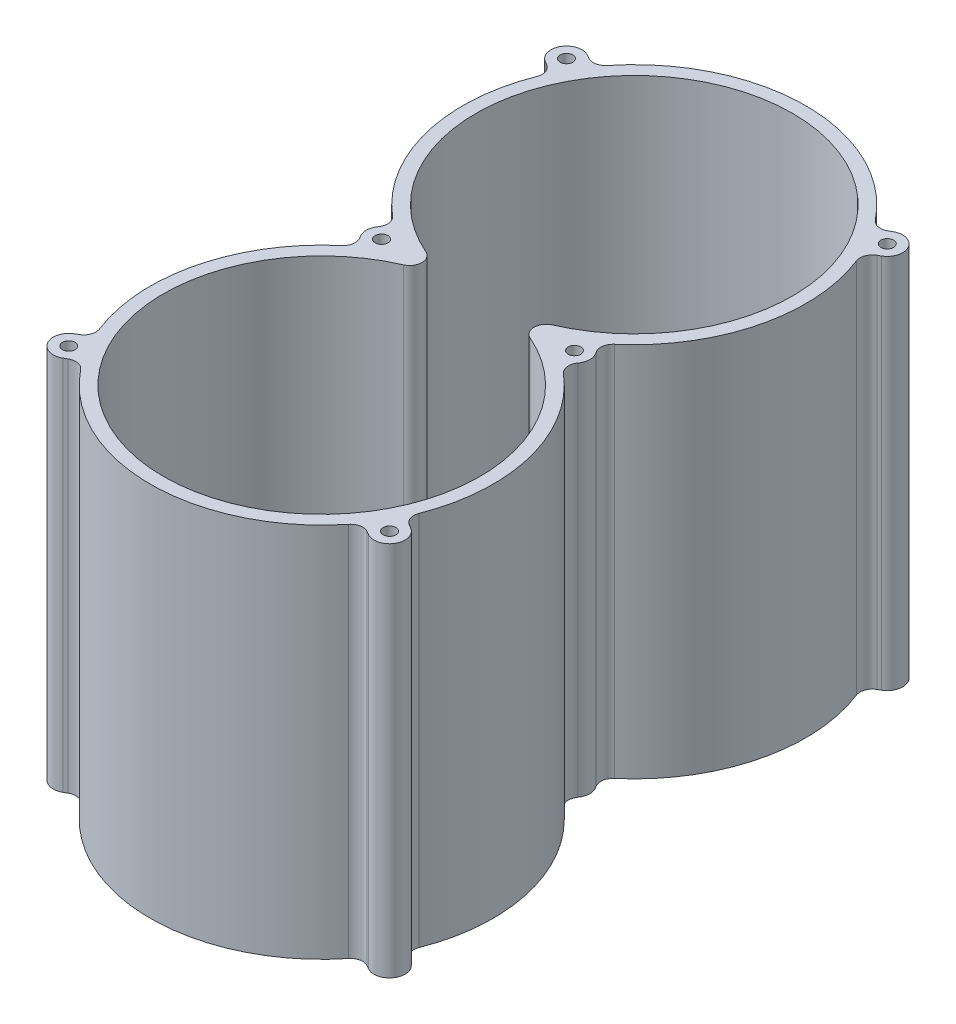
ISO-10303-21;
HEADER;
FILE_DESCRIPTION(('STEP AP214'),'2;1');
FILE_NAME('part.step','',(''),(''),'','','');
FILE_SCHEMA(('AUTOMOTIVE_DESIGN { 1 0 10303 214 1 1 1 1 }'));
ENDSEC;
DATA;
#1=APPLICATION_CONTEXT('core data for automotive mechanical design processes');
#2=APPLICATION_PROTOCOL_DEFINITION('international standard','automotive_design',2000,#1);
#3=PRODUCT_CONTEXT('',#1,'mechanical');
#4=PRODUCT('Part','Part','',(#3));
#5=PRODUCT_RELATED_PRODUCT_CATEGORY('part','',(#4));
#6=PRODUCT_DEFINITION_FORMATION('','',#4);
#7=PRODUCT_DEFINITION_CONTEXT('part definition',#1,'design');
#8=PRODUCT_DEFINITION('design','',#6,#7);
#9=PRODUCT_DEFINITION_SHAPE('','',#8);
#10=(LENGTH_UNIT() NAMED_UNIT(*) SI_UNIT(.MILLI.,.METRE.));
#11=(NAMED_UNIT(*) PLANE_ANGLE_UNIT() SI_UNIT($,.RADIAN.));
#12=(NAMED_UNIT(*) SI_UNIT($,.STERADIAN.) SOLID_ANGLE_UNIT());
#13=UNCERTAINTY_MEASURE_WITH_UNIT(LENGTH_MEASURE(1.E-05),#10,'distance_accuracy_value','');
#14=(GEOMETRIC_REPRESENTATION_CONTEXT(3) GLOBAL_UNCERTAINTY_ASSIGNED_CONTEXT((#13)) GLOBAL_UNIT_ASSIGNED_CONTEXT((#10,
#11,#12)) REPRESENTATION_CONTEXT('',''));
#15=CARTESIAN_POINT('',(0.,0.,0.));
#16=DIRECTION('',(0.,0.,1.));
#17=DIRECTION('',(1.,0.,0.));
#18=AXIS2_PLACEMENT_3D('',#15,#16,#17);
#19=CARTESIAN_POINT('',(0.,48.729999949,-40.5));
#20=DIRECTION('',(0.,-1.,0.));
#21=DIRECTION('',(0.,0.,-1.));
#22=AXIS2_PLACEMENT_3D('',#19,#20,#21);
#23=CYLINDRICAL_SURFACE('',#22,44.45);
#24=CARTESIAN_POINT('',(0.,48.729999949,-40.5));
#25=DIRECTION('',(0.,1.,0.));
#26=DIRECTION('',(0.,0.,1.));
#27=AXIS2_PLACEMENT_3D('',#24,#25,#26);
#28=CIRCLE('',#27,44.45);
#29=CARTESIAN_POINT('',(28.7670773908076,48.729999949,-6.61404777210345));
#30=VERTEX_POINT('',#29);
#31=CARTESIAN_POINT('',(41.4037911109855,48.729999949,-56.671845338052));
#32=VERTEX_POINT('',#31);
#33=EDGE_CURVE('E444',#30,#32,#28,.T.);
#34=ORIENTED_EDGE('',*,*,#33,.F.);
#35=DIRECTION('',(0.,-1.,0.));
#36=VECTOR('',#35,1.);
#37=CARTESIAN_POINT('',(28.7670773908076,48.729999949,-6.61404777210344));
#38=LINE('',#37,#36);
#39=CARTESIAN_POINT('',(28.7670773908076,-48.729999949,-6.61404777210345));
#40=VERTEX_POINT('',#39);
#41=EDGE_CURVE('E612',#30,#40,#38,.T.);
#42=ORIENTED_EDGE('',*,*,#41,.T.);
#43=CARTESIAN_POINT('',(0.,-48.729999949,-40.5));
#44=DIRECTION('',(0.,1.,0.));
#45=DIRECTION('',(0.,0.,1.));
#46=AXIS2_PLACEMENT_3D('',#43,#44,#45);
#47=CIRCLE('',#46,44.45);
#48=CARTESIAN_POINT('',(41.4037911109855,-48.729999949,-56.671845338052));
#49=VERTEX_POINT('',#48);
#50=EDGE_CURVE('E454',#40,#49,#47,.T.);
#51=ORIENTED_EDGE('',*,*,#50,.T.);
#52=DIRECTION('',(0.,-1.,0.));
#53=VECTOR('',#52,1.);
#54=CARTESIAN_POINT('',(41.4037911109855,48.729999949,-56.671845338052));
#55=LINE('',#54,#53);
#56=EDGE_CURVE('E485',#49,#32,#55,.F.);
#57=ORIENTED_EDGE('',*,*,#56,.T.);
#58=EDGE_LOOP('',(#34,#42,#51,#57));
#59=FACE_BOUND('',#58,.T.);
#60=ADVANCED_FACE('F53',(#59),#23,.T.);
#61=CARTESIAN_POINT('',(34.7071244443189,48.729999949,-68.2708122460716));
#62=VERTEX_POINT('',#61);
#63=CARTESIAN_POINT('',(-34.7071244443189,48.729999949,-68.2708122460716));
#64=VERTEX_POINT('',#63);
#65=EDGE_CURVE('E448',#62,#64,#28,.T.);
#66=ORIENTED_EDGE('',*,*,#65,.F.);
#67=DIRECTION('',(0.,-1.,0.));
#68=VECTOR('',#67,1.);
#69=CARTESIAN_POINT('',(34.7071244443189,48.729999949,-68.2708122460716));
#70=LINE('',#69,#68);
#71=CARTESIAN_POINT('',(34.7071244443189,-48.729999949,-68.2708122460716));
#72=VERTEX_POINT('',#71);
#73=EDGE_CURVE('E492',#62,#72,#70,.T.);
#74=ORIENTED_EDGE('',*,*,#73,.T.);
#75=CARTESIAN_POINT('',(-34.7071244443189,-48.729999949,-68.2708122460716));
#76=VERTEX_POINT('',#75);
#77=EDGE_CURVE('E457',#72,#76,#47,.T.);
#78=ORIENTED_EDGE('',*,*,#77,.T.);
#79=DIRECTION('',(0.,-1.,0.));
#80=VECTOR('',#79,1.);
#81=CARTESIAN_POINT('',(-34.7071244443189,48.729999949,-68.2708122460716));
#82=LINE('',#81,#80);
#83=EDGE_CURVE('E489',#76,#64,#82,.F.);
#84=ORIENTED_EDGE('',*,*,#83,.T.);
#85=EDGE_LOOP('',(#66,#74,#78,#84));
#86=FACE_BOUND('',#85,.T.);
#87=ADVANCED_FACE('F667',(#86),#23,.T.);
#88=CARTESIAN_POINT('',(0.,48.729999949,40.5));
#89=DIRECTION('',(0.,-1.,0.));
#90=DIRECTION('',(0.,0.,-1.));
#91=AXIS2_PLACEMENT_3D('',#88,#89,#90);
#92=CYLINDRICAL_SURFACE('',#91,44.45);
#93=CARTESIAN_POINT('',(0.,-48.729999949,40.5));
#94=DIRECTION('',(0.,1.,0.));
#95=DIRECTION('',(0.,0.,1.));
#96=AXIS2_PLACEMENT_3D('',#93,#94,#95);
#97=CIRCLE('',#96,44.45);
#98=CARTESIAN_POINT('',(41.4037911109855,-48.729999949,56.671845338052));
#99=VERTEX_POINT('',#98);
#100=CARTESIAN_POINT('',(28.7670773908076,-48.729999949,6.61404777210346));
#101=VERTEX_POINT('',#100);
#102=EDGE_CURVE('E431',#99,#101,#97,.T.);
#103=ORIENTED_EDGE('',*,*,#102,.T.);
#104=DIRECTION('',(0.,-1.,0.));
#105=VECTOR('',#104,1.);
#106=CARTESIAN_POINT('',(28.7670773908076,48.729999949,6.61404777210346));
#107=LINE('',#106,#105);
#108=CARTESIAN_POINT('',(28.7670773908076,48.729999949,6.61404777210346));
#109=VERTEX_POINT('',#108);
#110=EDGE_CURVE('E602',#101,#109,#107,.F.);
#111=ORIENTED_EDGE('',*,*,#110,.T.);
#112=CARTESIAN_POINT('',(0.,48.729999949,40.5));
#113=DIRECTION('',(0.,1.,0.));
#114=DIRECTION('',(0.,0.,1.));
#115=AXIS2_PLACEMENT_3D('',#112,#113,#114);
#116=CIRCLE('',#115,44.45);
#117=CARTESIAN_POINT('',(41.4037911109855,48.729999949,56.671845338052));
#118=VERTEX_POINT('',#117);
#119=EDGE_CURVE('E443',#118,#109,#116,.T.);
#120=ORIENTED_EDGE('',*,*,#119,.F.);
#121=DIRECTION('',(0.,-1.,0.));
#122=VECTOR('',#121,1.);
#123=CARTESIAN_POINT('',(41.4037911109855,48.729999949,56.671845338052));
#124=LINE('',#123,#122);
#125=EDGE_CURVE('E518',#118,#99,#124,.T.);
#126=ORIENTED_EDGE('',*,*,#125,.T.);
#127=EDGE_LOOP('',(#103,#111,#120,#126));
#128=FACE_BOUND('',#127,.T.);
#129=ADVANCED_FACE('F675',(#128),#92,.T.);
#130=CARTESIAN_POINT('',(-34.7071244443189,-48.729999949,68.2708122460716));
#131=VERTEX_POINT('',#130);
#132=CARTESIAN_POINT('',(34.7071244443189,-48.729999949,68.2708122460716));
#133=VERTEX_POINT('',#132);
#134=EDGE_CURVE('E453',#131,#133,#97,.T.);
#135=ORIENTED_EDGE('',*,*,#134,.T.);
#136=DIRECTION('',(0.,-1.,0.));
#137=VECTOR('',#136,1.);
#138=CARTESIAN_POINT('',(34.7071244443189,48.729999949,68.2708122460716));
#139=LINE('',#138,#137);
#140=CARTESIAN_POINT('',(34.7071244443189,48.729999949,68.2708122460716));
#141=VERTEX_POINT('',#140);
#142=EDGE_CURVE('E533',#133,#141,#139,.F.);
#143=ORIENTED_EDGE('',*,*,#142,.T.);
#144=CARTESIAN_POINT('',(-34.7071244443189,48.729999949,68.2708122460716));
#145=VERTEX_POINT('',#144);
#146=EDGE_CURVE('E442',#145,#141,#116,.T.);
#147=ORIENTED_EDGE('',*,*,#146,.F.);
#148=DIRECTION('',(0.,-1.,0.));
#149=VECTOR('',#148,1.);
#150=CARTESIAN_POINT('',(-34.7071244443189,48.729999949,68.2708122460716));
#151=LINE('',#150,#149);
#152=EDGE_CURVE('E529',#145,#131,#151,.T.);
#153=ORIENTED_EDGE('',*,*,#152,.T.);
#154=EDGE_LOOP('',(#135,#143,#147,#153));
#155=FACE_BOUND('',#154,.T.);
#156=ADVANCED_FACE('F847',(#155),#92,.T.);
#157=CARTESIAN_POINT('',(-28.7670773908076,48.729999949,6.61404777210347));
#158=VERTEX_POINT('',#157);
#159=CARTESIAN_POINT('',(-41.4037911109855,48.729999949,56.671845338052));
#160=VERTEX_POINT('',#159);
#161=EDGE_CURVE('E438',#158,#160,#116,.T.);
#162=ORIENTED_EDGE('',*,*,#161,.F.);
#163=DIRECTION('',(0.,-1.,0.));
#164=VECTOR('',#163,1.);
#165=CARTESIAN_POINT('',(-28.7670773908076,48.729999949,6.61404777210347));
#166=LINE('',#165,#164);
#167=CARTESIAN_POINT('',(-28.7670773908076,-48.729999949,6.61404777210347));
#168=VERTEX_POINT('',#167);
#169=EDGE_CURVE('E598',#158,#168,#166,.T.);
#170=ORIENTED_EDGE('',*,*,#169,.T.);
#171=CARTESIAN_POINT('',(-41.4037911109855,-48.729999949,56.671845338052));
#172=VERTEX_POINT('',#171);
#173=EDGE_CURVE('E449',#168,#172,#97,.T.);
#174=ORIENTED_EDGE('',*,*,#173,.T.);
#175=DIRECTION('',(0.,-1.,0.));
#176=VECTOR('',#175,1.);
#177=CARTESIAN_POINT('',(-41.4037911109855,48.729999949,56.671845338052));
#178=LINE('',#177,#176);
#179=EDGE_CURVE('E514',#172,#160,#178,.F.);
#180=ORIENTED_EDGE('',*,*,#179,.T.);
#181=EDGE_LOOP('',(#162,#170,#174,#180));
#182=FACE_BOUND('',#181,.T.);
#183=ADVANCED_FACE('F843',(#182),#92,.T.);
#184=CARTESIAN_POINT('',(0.,48.729999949,0.));
#185=DIRECTION('',(0.,1.,0.));
#186=DIRECTION('',(0.,0.,1.));
#187=AXIS2_PLACEMENT_3D('',#184,#185,#186);
#188=PLANE('',#187);
#189=CARTESIAN_POINT('',(25.,48.729999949,0.));
#190=DIRECTION('',(0.,-1.,0.));
#191=DIRECTION('',(0.,0.,-1.));
#192=AXIS2_PLACEMENT_3D('',#189,#190,#191);
#193=CIRCLE('',#192,1.64999999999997);
#194=CARTESIAN_POINT('',(25.,48.729999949,-1.64999999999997));
#195=VERTEX_POINT('',#194);
#196=EDGE_CURVE('E756',#195,#195,#193,.T.);
#197=ORIENTED_EDGE('',*,*,#196,.T.);
#198=EDGE_LOOP('',(#197));
#199=FACE_BOUND('',#198,.T.);
#200=CARTESIAN_POINT('',(41.5692193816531,48.729999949,-64.4999999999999));
#201=DIRECTION('',(0.,-1.,0.));
#202=DIRECTION('',(0.,0.,-1.));
#203=AXIS2_PLACEMENT_3D('',#200,#201,#202);
#204=CIRCLE('',#203,1.64999999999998);
#205=CARTESIAN_POINT('',(41.5692193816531,48.729999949,-66.1499999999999));
#206=VERTEX_POINT('',#205);
#207=EDGE_CURVE('E748',#206,#206,#204,.T.);
#208=ORIENTED_EDGE('',*,*,#207,.T.);
#209=EDGE_LOOP('',(#208));
#210=FACE_BOUND('',#209,.T.);
#211=CARTESIAN_POINT('',(-41.5692193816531,48.729999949,-64.4999999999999));
#212=DIRECTION('',(0.,-1.,0.));
#213=DIRECTION('',(0.,0.,-1.));
#214=AXIS2_PLACEMENT_3D('',#211,#212,#213);
#215=CIRCLE('',#214,1.64999999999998);
#216=CARTESIAN_POINT('',(-41.5692193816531,48.729999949,-66.1499999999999));
#217=VERTEX_POINT('',#216);
#218=EDGE_CURVE('E740',#217,#217,#215,.T.);
#219=ORIENTED_EDGE('',*,*,#218,.T.);
#220=EDGE_LOOP('',(#219));
#221=FACE_BOUND('',#220,.T.);
#222=CARTESIAN_POINT('',(-25.,48.729999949,0.));
#223=DIRECTION('',(0.,-1.,0.));
#224=DIRECTION('',(0.,0.,-1.));
#225=AXIS2_PLACEMENT_3D('',#222,#223,#224);
#226=CIRCLE('',#225,1.64999999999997);
#227=CARTESIAN_POINT('',(-25.,48.729999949,-1.64999999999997));
#228=VERTEX_POINT('',#227);
#229=EDGE_CURVE('E732',#228,#228,#226,.T.);
#230=ORIENTED_EDGE('',*,*,#229,.T.);
#231=EDGE_LOOP('',(#230));
#232=FACE_BOUND('',#231,.T.);
#233=CARTESIAN_POINT('',(-41.5692193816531,48.729999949,64.4999999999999));
#234=DIRECTION('',(0.,-1.,0.));
#235=DIRECTION('',(0.,0.,-1.));
#236=AXIS2_PLACEMENT_3D('',#233,#234,#235);
#237=CIRCLE('',#236,1.64999999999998);
#238=CARTESIAN_POINT('',(-41.5692193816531,48.729999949,62.8499999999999));
#239=VERTEX_POINT('',#238);
#240=EDGE_CURVE('E724',#239,#239,#237,.T.);
#241=ORIENTED_EDGE('',*,*,#240,.T.);
#242=EDGE_LOOP('',(#241));
#243=FACE_BOUND('',#242,.T.);
#244=CARTESIAN_POINT('',(41.5692193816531,48.729999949,64.4999999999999));
#245=DIRECTION('',(0.,-1.,0.));
#246=DIRECTION('',(0.,0.,-1.));
#247=AXIS2_PLACEMENT_3D('',#244,#245,#246);
#248=CIRCLE('',#247,1.64999999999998);
#249=CARTESIAN_POINT('',(41.5692193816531,48.729999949,62.8499999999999));
#250=VERTEX_POINT('',#249);
#251=EDGE_CURVE('E716',#250,#250,#248,.T.);
#252=ORIENTED_EDGE('',*,*,#251,.T.);
#253=EDGE_LOOP('',(#252));
#254=FACE_BOUND('',#253,.T.);
#255=CARTESIAN_POINT('',(25.,48.729999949,0.));
#256=DIRECTION('',(0.,1.,0.));
#257=DIRECTION('',(0.,0.,1.));
#258=AXIS2_PLACEMENT_3D('',#255,#256,#257);
#259=CIRCLE('',#258,4.);
#260=CARTESIAN_POINT('',(28.2456410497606,48.729999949,-2.33790807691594));
#261=VERTEX_POINT('',#260);
#262=CARTESIAN_POINT('',(28.2456410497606,48.729999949,2.33790807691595));
#263=VERTEX_POINT('',#262);
#264=EDGE_CURVE('E643',#261,#263,#259,.F.);
#265=ORIENTED_EDGE('',*,*,#264,.F.);
#266=CARTESIAN_POINT('',(30.8218686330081,48.729999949,-4.19362261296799));
#267=DIRECTION('',(0.,1.,0.));
#268=DIRECTION('',(0.,0.,1.));
#269=AXIS2_PLACEMENT_3D('',#266,#267,#268);
#270=CIRCLE('',#269,3.175);
#271=EDGE_CURVE('E11',#261,#30,#270,.F.);
#272=ORIENTED_EDGE('',*,*,#271,.T.);
#273=ORIENTED_EDGE('',*,*,#33,.T.);
#274=CARTESIAN_POINT('',(44.3612047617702,48.729999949,-57.8269771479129));
#275=DIRECTION('',(0.,1.,0.));
#276=DIRECTION('',(0.,0.,1.));
#277=AXIS2_PLACEMENT_3D('',#274,#275,#276);
#278=CIRCLE('',#277,3.175);
#279=CARTESIAN_POINT('',(42.7737047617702,48.729999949,-60.5766078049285));
#280=VERTEX_POINT('',#279);
#281=EDGE_CURVE('E542',#32,#280,#278,.F.);
#282=ORIENTED_EDGE('',*,*,#281,.T.);
#283=DIRECTION('',(-0.866025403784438,0.,0.500000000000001));
#284=VECTOR('',#283,1.);
#285=CARTESIAN_POINT('',(43.5692193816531,48.729999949,-61.0358983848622));
#286=LINE('',#285,#284);
#287=CARTESIAN_POINT('',(43.5692193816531,48.729999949,-61.0358983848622));
#288=VERTEX_POINT('',#287);
#289=EDGE_CURVE('E320',#288,#280,#286,.T.);
#290=ORIENTED_EDGE('',*,*,#289,.F.);
#291=CARTESIAN_POINT('',(41.5692193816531,48.729999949,-64.4999999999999));
#292=DIRECTION('',(0.,1.,0.));
#293=DIRECTION('',(0.,0.,1.));
#294=AXIS2_PLACEMENT_3D('',#291,#292,#293);
#295=CIRCLE('',#294,3.99999999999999);
#296=CARTESIAN_POINT('',(39.5692193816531,48.729999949,-67.9641016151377));
#297=VERTEX_POINT('',#296);
#298=EDGE_CURVE('E293',#297,#288,#295,.F.);
#299=ORIENTED_EDGE('',*,*,#298,.F.);
#300=DIRECTION('',(0.86602540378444,0.,-0.499999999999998));
#301=VECTOR('',#300,1.);
#302=CARTESIAN_POINT('',(39.5692193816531,48.729999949,-67.9641016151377));
#303=LINE('',#302,#301);
#304=CARTESIAN_POINT('',(38.7737047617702,48.729999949,-67.504811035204));
#305=VERTEX_POINT('',#304);
#306=EDGE_CURVE('E327',#305,#297,#303,.T.);
#307=ORIENTED_EDGE('',*,*,#306,.F.);
#308=CARTESIAN_POINT('',(37.1862047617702,48.729999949,-70.2544416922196));
#309=DIRECTION('',(0.,1.,0.));
#310=DIRECTION('',(0.,0.,1.));
#311=AXIS2_PLACEMENT_3D('',#308,#309,#310);
#312=CIRCLE('',#311,3.175);
#313=EDGE_CURVE('E548',#305,#62,#312,.F.);
#314=ORIENTED_EDGE('',*,*,#313,.T.);
#315=ORIENTED_EDGE('',*,*,#65,.T.);
#316=CARTESIAN_POINT('',(-37.1862047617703,48.729999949,-70.2544416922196));
#317=DIRECTION('',(0.,1.,0.));
#318=DIRECTION('',(0.,0.,1.));
#319=AXIS2_PLACEMENT_3D('',#316,#317,#318);
#320=CIRCLE('',#319,3.175);
#321=CARTESIAN_POINT('',(-38.7737047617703,48.729999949,-67.504811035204));
#322=VERTEX_POINT('',#321);
#323=EDGE_CURVE('E554',#64,#322,#320,.F.);
#324=ORIENTED_EDGE('',*,*,#323,.T.);
#325=DIRECTION('',(0.866025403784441,0.,0.499999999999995));
#326=VECTOR('',#325,1.);
#327=CARTESIAN_POINT('',(-39.5692193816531,48.729999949,-67.9641016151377));
#328=LINE('',#327,#326);
#329=CARTESIAN_POINT('',(-39.5692193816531,48.729999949,-67.9641016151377));
#330=VERTEX_POINT('',#329);
#331=EDGE_CURVE('E342',#330,#322,#328,.T.);
#332=ORIENTED_EDGE('',*,*,#331,.F.);
#333=CARTESIAN_POINT('',(-41.5692193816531,48.729999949,-64.4999999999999));
#334=DIRECTION('',(0.,1.,0.));
#335=DIRECTION('',(0.,0.,1.));
#336=AXIS2_PLACEMENT_3D('',#333,#334,#335);
#337=CIRCLE('',#336,3.99999999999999);
#338=CARTESIAN_POINT('',(-43.5692193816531,48.729999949,-61.0358983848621));
#339=VERTEX_POINT('',#338);
#340=EDGE_CURVE('E350',#339,#330,#337,.F.);
#341=ORIENTED_EDGE('',*,*,#340,.F.);
#342=DIRECTION('',(-0.86602540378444,0.,-0.499999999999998));
#343=VECTOR('',#342,1.);
#344=CARTESIAN_POINT('',(-43.5692193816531,48.729999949,-61.0358983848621));
#345=LINE('',#344,#343);
#346=CARTESIAN_POINT('',(-42.7737047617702,48.729999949,-60.5766078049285));
#347=VERTEX_POINT('',#346);
#348=EDGE_CURVE('E349',#347,#339,#345,.T.);
#349=ORIENTED_EDGE('',*,*,#348,.F.);
#350=CARTESIAN_POINT('',(-44.3612047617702,48.729999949,-57.8269771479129));
#351=DIRECTION('',(0.,1.,0.));
#352=DIRECTION('',(0.,0.,1.));
#353=AXIS2_PLACEMENT_3D('',#350,#351,#352);
#354=CIRCLE('',#353,3.175);
#355=CARTESIAN_POINT('',(-41.4037911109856,48.729999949,-56.671845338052));
#356=VERTEX_POINT('',#355);
#357=EDGE_CURVE('E560',#347,#356,#354,.F.);
#358=ORIENTED_EDGE('',*,*,#357,.T.);
#359=CARTESIAN_POINT('',(-28.7670773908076,48.729999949,-6.61404777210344));
#360=VERTEX_POINT('',#359);
#361=EDGE_CURVE('E441',#356,#360,#28,.T.);
#362=ORIENTED_EDGE('',*,*,#361,.T.);
#363=CARTESIAN_POINT('',(-30.8218686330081,48.729999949,-4.19362261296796));
#364=DIRECTION('',(0.,1.,0.));
#365=DIRECTION('',(0.,0.,1.));
#366=AXIS2_PLACEMENT_3D('',#363,#364,#365);
#367=CIRCLE('',#366,3.175);
#368=CARTESIAN_POINT('',(-28.2456410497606,48.729999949,-2.33790807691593));
#369=VERTEX_POINT('',#368);
#370=EDGE_CURVE('E615',#360,#369,#367,.F.);
#371=ORIENTED_EDGE('',*,*,#370,.T.);
#372=CARTESIAN_POINT('',(-25.,48.729999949,0.));
#373=DIRECTION('',(0.,1.,0.));
#374=DIRECTION('',(0.,0.,1.));
#375=AXIS2_PLACEMENT_3D('',#372,#373,#374);
#376=CIRCLE('',#375,4.);
#377=CARTESIAN_POINT('',(-28.2456410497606,48.729999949,2.33790807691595));
#378=VERTEX_POINT('',#377);
#379=EDGE_CURVE('E311',#378,#369,#376,.F.);
#380=ORIENTED_EDGE('',*,*,#379,.F.);
#381=CARTESIAN_POINT('',(-30.8218686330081,48.729999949,4.19362261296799));
#382=DIRECTION('',(0.,1.,0.));
#383=DIRECTION('',(0.,0.,1.));
#384=AXIS2_PLACEMENT_3D('',#381,#382,#383);
#385=CIRCLE('',#384,3.175);
#386=EDGE_CURVE('E624',#378,#158,#385,.F.);
#387=ORIENTED_EDGE('',*,*,#386,.T.);
#388=ORIENTED_EDGE('',*,*,#161,.T.);
#389=CARTESIAN_POINT('',(-44.3612047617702,48.729999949,57.8269771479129));
#390=DIRECTION('',(0.,1.,0.));
#391=DIRECTION('',(0.,0.,1.));
#392=AXIS2_PLACEMENT_3D('',#389,#390,#391);
#393=CIRCLE('',#392,3.175);
#394=CARTESIAN_POINT('',(-42.7737047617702,48.729999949,60.5766078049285));
#395=VERTEX_POINT('',#394);
#396=EDGE_CURVE('E567',#160,#395,#393,.F.);
#397=ORIENTED_EDGE('',*,*,#396,.T.);
#398=DIRECTION('',(-0.86602540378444,0.,0.499999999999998));
#399=VECTOR('',#398,1.);
#400=CARTESIAN_POINT('',(-43.5692193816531,48.729999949,61.0358983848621));
#401=LINE('',#400,#399);
#402=CARTESIAN_POINT('',(-43.5692193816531,48.729999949,61.0358983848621));
#403=VERTEX_POINT('',#402);
#404=EDGE_CURVE('E396',#395,#403,#401,.T.);
#405=ORIENTED_EDGE('',*,*,#404,.T.);
#406=CARTESIAN_POINT('',(-41.5692193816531,48.729999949,64.4999999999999));
#407=DIRECTION('',(0.,1.,0.));
#408=DIRECTION('',(0.,0.,1.));
#409=AXIS2_PLACEMENT_3D('',#406,#407,#408);
#410=CIRCLE('',#409,3.99999999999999);
#411=CARTESIAN_POINT('',(-39.5692193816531,48.729999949,67.9641016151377));
#412=VERTEX_POINT('',#411);
#413=EDGE_CURVE('E411',#403,#412,#410,.T.);
#414=ORIENTED_EDGE('',*,*,#413,.T.);
#415=DIRECTION('',(0.866025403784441,0.,-0.499999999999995));
#416=VECTOR('',#415,1.);
#417=CARTESIAN_POINT('',(-39.5692193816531,48.729999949,67.9641016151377));
#418=LINE('',#417,#416);
#419=CARTESIAN_POINT('',(-38.7737047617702,48.729999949,67.504811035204));
#420=VERTEX_POINT('',#419);
#421=EDGE_CURVE('E406',#412,#420,#418,.T.);
#422=ORIENTED_EDGE('',*,*,#421,.T.);
#423=CARTESIAN_POINT('',(-37.1862047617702,48.729999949,70.2544416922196));
#424=DIRECTION('',(0.,1.,0.));
#425=DIRECTION('',(0.,0.,1.));
#426=AXIS2_PLACEMENT_3D('',#423,#424,#425);
#427=CIRCLE('',#426,3.175);
#428=EDGE_CURVE('E585',#420,#145,#427,.F.);
#429=ORIENTED_EDGE('',*,*,#428,.T.);
#430=ORIENTED_EDGE('',*,*,#146,.T.);
#431=CARTESIAN_POINT('',(37.1862047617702,48.729999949,70.2544416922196));
#432=DIRECTION('',(0.,1.,0.));
#433=DIRECTION('',(0.,0.,1.));
#434=AXIS2_PLACEMENT_3D('',#431,#432,#433);
#435=CIRCLE('',#434,3.175);
#436=CARTESIAN_POINT('',(38.7737047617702,48.729999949,67.504811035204));
#437=VERTEX_POINT('',#436);
#438=EDGE_CURVE('E579',#141,#437,#435,.F.);
#439=ORIENTED_EDGE('',*,*,#438,.T.);
#440=DIRECTION('',(0.86602540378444,0.,0.499999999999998));
#441=VECTOR('',#440,1.);
#442=CARTESIAN_POINT('',(39.5692193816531,48.729999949,67.9641016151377));
#443=LINE('',#442,#441);
#444=CARTESIAN_POINT('',(39.5692193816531,48.729999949,67.9641016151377));
#445=VERTEX_POINT('',#444);
#446=EDGE_CURVE('E367',#437,#445,#443,.T.);
#447=ORIENTED_EDGE('',*,*,#446,.T.);
#448=CARTESIAN_POINT('',(41.5692193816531,48.729999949,64.4999999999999));
#449=DIRECTION('',(0.,1.,0.));
#450=DIRECTION('',(0.,0.,1.));
#451=AXIS2_PLACEMENT_3D('',#448,#449,#450);
#452=CIRCLE('',#451,3.99999999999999);
#453=CARTESIAN_POINT('',(43.5692193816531,48.729999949,61.0358983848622));
#454=VERTEX_POINT('',#453);
#455=EDGE_CURVE('E382',#445,#454,#452,.T.);
#456=ORIENTED_EDGE('',*,*,#455,.T.);
#457=DIRECTION('',(-0.866025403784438,0.,-0.500000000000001));
#458=VECTOR('',#457,1.);
#459=CARTESIAN_POINT('',(43.5692193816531,48.729999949,61.0358983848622));
#460=LINE('',#459,#458);
#461=CARTESIAN_POINT('',(42.7737047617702,48.729999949,60.5766078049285));
#462=VERTEX_POINT('',#461);
#463=EDGE_CURVE('E377',#454,#462,#460,.T.);
#464=ORIENTED_EDGE('',*,*,#463,.T.);
#465=CARTESIAN_POINT('',(44.3612047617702,48.729999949,57.8269771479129));
#466=DIRECTION('',(0.,1.,0.));
#467=DIRECTION('',(0.,0.,1.));
#468=AXIS2_PLACEMENT_3D('',#465,#466,#467);
#469=CIRCLE('',#468,3.175);
#470=EDGE_CURVE('E573',#462,#118,#469,.F.);
#471=ORIENTED_EDGE('',*,*,#470,.T.);
#472=ORIENTED_EDGE('',*,*,#119,.T.);
#473=CARTESIAN_POINT('',(30.8218686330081,48.729999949,4.19362261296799));
#474=DIRECTION('',(0.,1.,0.));
#475=DIRECTION('',(0.,0.,1.));
#476=AXIS2_PLACEMENT_3D('',#473,#474,#475);
#477=CIRCLE('',#476,3.175);
#478=EDGE_CURVE('E627',#109,#263,#477,.F.);
#479=ORIENTED_EDGE('',*,*,#478,.T.);
#480=EDGE_LOOP('',(#265,#272,#273,#282,#290,#299,#307,#314,#315,#324,#332,#341,#349,#358,#362,
#371,#380,#387,#388,#397,#405,#414,#422,#429,#430,#439,#447,#456,#464,#471,#472,#479));
#481=FACE_BOUND('',#480,.T.);
#482=CARTESIAN_POINT('',(0.,48.729999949,-40.5));
#483=DIRECTION('',(0.,1.,0.));
#484=DIRECTION('',(0.,0.,1.));
#485=AXIS2_PLACEMENT_3D('',#482,#483,#484);
#486=CIRCLE('',#485,41.021);
#487=CARTESIAN_POINT('',(16.4217981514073,48.729999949,-2.9094827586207));
#488=VERTEX_POINT('',#487);
#489=CARTESIAN_POINT('',(-16.4217981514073,48.729999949,-2.90948275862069));
#490=VERTEX_POINT('',#489);
#491=EDGE_CURVE('E426',#488,#490,#486,.T.);
#492=ORIENTED_EDGE('',*,*,#491,.F.);
#493=CARTESIAN_POINT('',(17.6928351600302,48.729999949,0.));
#494=DIRECTION('',(0.,1.,0.));
#495=DIRECTION('',(0.,0.,1.));
#496=AXIS2_PLACEMENT_3D('',#493,#494,#495);
#497=CIRCLE('',#496,3.175);
#498=CARTESIAN_POINT('',(16.4217981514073,48.729999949,2.90948275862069));
#499=VERTEX_POINT('',#498);
#500=EDGE_CURVE('E480',#488,#499,#497,.T.);
#501=ORIENTED_EDGE('',*,*,#500,.T.);
#502=CARTESIAN_POINT('',(0.,48.729999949,40.5));
#503=DIRECTION('',(0.,1.,0.));
#504=DIRECTION('',(0.,0.,1.));
#505=AXIS2_PLACEMENT_3D('',#502,#503,#504);
#506=CIRCLE('',#505,41.021);
#507=CARTESIAN_POINT('',(-16.4217981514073,48.729999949,2.9094827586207));
#508=VERTEX_POINT('',#507);
#509=EDGE_CURVE('E422',#508,#499,#506,.T.);
#510=ORIENTED_EDGE('',*,*,#509,.F.);
#511=CARTESIAN_POINT('',(-17.6928351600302,48.729999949,0.));
#512=DIRECTION('',(0.,1.,0.));
#513=DIRECTION('',(0.,0.,1.));
#514=AXIS2_PLACEMENT_3D('',#511,#512,#513);
#515=CIRCLE('',#514,3.175);
#516=EDGE_CURVE('E477',#508,#490,#515,.T.);
#517=ORIENTED_EDGE('',*,*,#516,.T.);
#518=EDGE_LOOP('',(#492,#501,#510,#517));
#519=FACE_BOUND('',#518,.T.);
#520=ADVANCED_FACE('F648',(#199,#210,#221,#232,#243,#254,#481,#519),#188,.T.);
#521=CARTESIAN_POINT('',(0.,-48.729999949,0.));
#522=DIRECTION('',(0.,1.,0.));
#523=DIRECTION('',(0.,0.,1.));
#524=AXIS2_PLACEMENT_3D('',#521,#522,#523);
#525=PLANE('',#524);
#526=CARTESIAN_POINT('',(25.,-48.729999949,0.));
#527=DIRECTION('',(0.,-1.,0.));
#528=DIRECTION('',(0.,0.,-1.));
#529=AXIS2_PLACEMENT_3D('',#526,#527,#528);
#530=CIRCLE('',#529,1.64999999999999);
#531=CARTESIAN_POINT('',(25.,-48.729999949,-1.64999999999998));
#532=VERTEX_POINT('',#531);
#533=EDGE_CURVE('E760',#532,#532,#530,.T.);
#534=ORIENTED_EDGE('',*,*,#533,.F.);
#535=EDGE_LOOP('',(#534));
#536=FACE_BOUND('',#535,.T.);
#537=CARTESIAN_POINT('',(41.5692193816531,-48.729999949,-64.4999999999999));
#538=DIRECTION('',(0.,-1.,0.));
#539=DIRECTION('',(0.,0.,-1.));
#540=AXIS2_PLACEMENT_3D('',#537,#538,#539);
#541=CIRCLE('',#540,1.64999999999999);
#542=CARTESIAN_POINT('',(41.5692193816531,-48.729999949,-66.1499999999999));
#543=VERTEX_POINT('',#542);
#544=EDGE_CURVE('E752',#543,#543,#541,.T.);
#545=ORIENTED_EDGE('',*,*,#544,.F.);
#546=EDGE_LOOP('',(#545));
#547=FACE_BOUND('',#546,.T.);
#548=CARTESIAN_POINT('',(-41.5692193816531,-48.729999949,-64.4999999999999));
#549=DIRECTION('',(0.,-1.,0.));
#550=DIRECTION('',(0.,0.,-1.));
#551=AXIS2_PLACEMENT_3D('',#548,#549,#550);
#552=CIRCLE('',#551,1.64999999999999);
#553=CARTESIAN_POINT('',(-41.5692193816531,-48.729999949,-66.1499999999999));
#554=VERTEX_POINT('',#553);
#555=EDGE_CURVE('E744',#554,#554,#552,.T.);
#556=ORIENTED_EDGE('',*,*,#555,.F.);
#557=EDGE_LOOP('',(#556));
#558=FACE_BOUND('',#557,.T.);
#559=CARTESIAN_POINT('',(-25.,-48.729999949,0.));
#560=DIRECTION('',(0.,-1.,0.));
#561=DIRECTION('',(0.,0.,-1.));
#562=AXIS2_PLACEMENT_3D('',#559,#560,#561);
#563=CIRCLE('',#562,1.64999999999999);
#564=CARTESIAN_POINT('',(-25.,-48.729999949,-1.64999999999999));
#565=VERTEX_POINT('',#564);
#566=EDGE_CURVE('E736',#565,#565,#563,.T.);
#567=ORIENTED_EDGE('',*,*,#566,.F.);
#568=EDGE_LOOP('',(#567));
#569=FACE_BOUND('',#568,.T.);
#570=CARTESIAN_POINT('',(-41.5692193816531,-48.729999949,64.4999999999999));
#571=DIRECTION('',(0.,-1.,0.));
#572=DIRECTION('',(0.,0.,-1.));
#573=AXIS2_PLACEMENT_3D('',#570,#571,#572);
#574=CIRCLE('',#573,1.64999999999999);
#575=CARTESIAN_POINT('',(-41.5692193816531,-48.729999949,62.8499999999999));
#576=VERTEX_POINT('',#575);
#577=EDGE_CURVE('E728',#576,#576,#574,.T.);
#578=ORIENTED_EDGE('',*,*,#577,.F.);
#579=EDGE_LOOP('',(#578));
#580=FACE_BOUND('',#579,.T.);
#581=CARTESIAN_POINT('',(41.5692193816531,-48.729999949,64.4999999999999));
#582=DIRECTION('',(0.,-1.,0.));
#583=DIRECTION('',(0.,0.,-1.));
#584=AXIS2_PLACEMENT_3D('',#581,#582,#583);
#585=CIRCLE('',#584,1.64999999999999);
#586=CARTESIAN_POINT('',(41.5692193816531,-48.729999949,62.8499999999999));
#587=VERTEX_POINT('',#586);
#588=EDGE_CURVE('E720',#587,#587,#585,.T.);
#589=ORIENTED_EDGE('',*,*,#588,.F.);
#590=EDGE_LOOP('',(#589));
#591=FACE_BOUND('',#590,.T.);
#592=ORIENTED_EDGE('',*,*,#50,.F.);
#593=CARTESIAN_POINT('',(30.8218686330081,-48.729999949,-4.19362261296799));
#594=DIRECTION('',(0.,1.,0.));
#595=DIRECTION('',(0.,0.,1.));
#596=AXIS2_PLACEMENT_3D('',#593,#594,#595);
#597=CIRCLE('',#596,3.175);
#598=CARTESIAN_POINT('',(28.2456410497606,-48.729999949,-2.33790807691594));
#599=VERTEX_POINT('',#598);
#600=EDGE_CURVE('E62',#40,#599,#597,.T.);
#601=ORIENTED_EDGE('',*,*,#600,.T.);
#602=CARTESIAN_POINT('',(25.,-48.729999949,0.));
#603=DIRECTION('',(0.,-1.,0.));
#604=DIRECTION('',(0.,0.,-1.));
#605=AXIS2_PLACEMENT_3D('',#602,#603,#604);
#606=CIRCLE('',#605,4.);
#607=CARTESIAN_POINT('',(28.2456410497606,-48.729999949,2.33790807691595));
#608=VERTEX_POINT('',#607);
#609=EDGE_CURVE('E635',#599,#608,#606,.T.);
#610=ORIENTED_EDGE('',*,*,#609,.T.);
#611=CARTESIAN_POINT('',(30.8218686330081,-48.729999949,4.19362261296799));
#612=DIRECTION('',(0.,1.,0.));
#613=DIRECTION('',(0.,0.,1.));
#614=AXIS2_PLACEMENT_3D('',#611,#612,#613);
#615=CIRCLE('',#614,3.175);
#616=EDGE_CURVE('E630',#608,#101,#615,.T.);
#617=ORIENTED_EDGE('',*,*,#616,.T.);
#618=ORIENTED_EDGE('',*,*,#102,.F.);
#619=CARTESIAN_POINT('',(44.3612047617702,-48.729999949,57.8269771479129));
#620=DIRECTION('',(0.,1.,0.));
#621=DIRECTION('',(0.,0.,1.));
#622=AXIS2_PLACEMENT_3D('',#619,#620,#621);
#623=CIRCLE('',#622,3.175);
#624=CARTESIAN_POINT('',(42.7737047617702,-48.729999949,60.5766078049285));
#625=VERTEX_POINT('',#624);
#626=EDGE_CURVE('E570',#99,#625,#623,.T.);
#627=ORIENTED_EDGE('',*,*,#626,.T.);
#628=DIRECTION('',(-0.866025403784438,0.,-0.500000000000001));
#629=VECTOR('',#628,1.);
#630=CARTESIAN_POINT('',(43.5692193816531,-48.729999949,61.0358983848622));
#631=LINE('',#630,#629);
#632=CARTESIAN_POINT('',(43.5692193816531,-48.729999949,61.0358983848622));
#633=VERTEX_POINT('',#632);
#634=EDGE_CURVE('E368',#633,#625,#631,.T.);
#635=ORIENTED_EDGE('',*,*,#634,.F.);
#636=CARTESIAN_POINT('',(41.5692193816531,-48.729999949,64.4999999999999));
#637=DIRECTION('',(0.,1.,0.));
#638=DIRECTION('',(0.866025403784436,0.,-0.500000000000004));
#639=AXIS2_PLACEMENT_3D('',#636,#637,#638);
#640=CIRCLE('',#639,3.99999999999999);
#641=CARTESIAN_POINT('',(39.5692193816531,-48.729999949,67.9641016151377));
#642=VERTEX_POINT('',#641);
#643=EDGE_CURVE('E373',#642,#633,#640,.T.);
#644=ORIENTED_EDGE('',*,*,#643,.F.);
#645=DIRECTION('',(0.86602540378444,0.,0.499999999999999));
#646=VECTOR('',#645,1.);
#647=CARTESIAN_POINT('',(39.5692193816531,-48.729999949,67.9641016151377));
#648=LINE('',#647,#646);
#649=CARTESIAN_POINT('',(38.7737047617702,-48.729999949,67.504811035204));
#650=VERTEX_POINT('',#649);
#651=EDGE_CURVE('E364',#650,#642,#648,.T.);
#652=ORIENTED_EDGE('',*,*,#651,.F.);
#653=CARTESIAN_POINT('',(37.1862047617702,-48.729999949,70.2544416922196));
#654=DIRECTION('',(0.,1.,0.));
#655=DIRECTION('',(0.,0.,1.));
#656=AXIS2_PLACEMENT_3D('',#653,#654,#655);
#657=CIRCLE('',#656,3.175);
#658=EDGE_CURVE('E576',#650,#133,#657,.T.);
#659=ORIENTED_EDGE('',*,*,#658,.T.);
#660=ORIENTED_EDGE('',*,*,#134,.F.);
#661=CARTESIAN_POINT('',(-37.1862047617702,-48.729999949,70.2544416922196));
#662=DIRECTION('',(0.,1.,0.));
#663=DIRECTION('',(0.,0.,1.));
#664=AXIS2_PLACEMENT_3D('',#661,#662,#663);
#665=CIRCLE('',#664,3.175);
#666=CARTESIAN_POINT('',(-38.7737047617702,-48.729999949,67.504811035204));
#667=VERTEX_POINT('',#666);
#668=EDGE_CURVE('E582',#131,#667,#665,.T.);
#669=ORIENTED_EDGE('',*,*,#668,.T.);
#670=DIRECTION('',(0.866025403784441,0.,-0.499999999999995));
#671=VECTOR('',#670,1.);
#672=CARTESIAN_POINT('',(-39.5692193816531,-48.729999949,67.9641016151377));
#673=LINE('',#672,#671);
#674=CARTESIAN_POINT('',(-39.5692193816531,-48.729999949,67.9641016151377));
#675=VERTEX_POINT('',#674);
#676=EDGE_CURVE('E397',#675,#667,#673,.T.);
#677=ORIENTED_EDGE('',*,*,#676,.F.);
#678=CARTESIAN_POINT('',(-41.5692193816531,-48.729999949,64.4999999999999));
#679=DIRECTION('',(0.,1.,0.));
#680=DIRECTION('',(0.,0.,1.));
#681=AXIS2_PLACEMENT_3D('',#678,#679,#680);
#682=CIRCLE('',#681,3.99999999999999);
#683=CARTESIAN_POINT('',(-43.5692193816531,-48.729999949,61.0358983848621));
#684=VERTEX_POINT('',#683);
#685=EDGE_CURVE('E402',#684,#675,#682,.T.);
#686=ORIENTED_EDGE('',*,*,#685,.F.);
#687=DIRECTION('',(-0.86602540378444,0.,0.499999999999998));
#688=VECTOR('',#687,1.);
#689=CARTESIAN_POINT('',(-43.5692193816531,-48.729999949,61.0358983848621));
#690=LINE('',#689,#688);
#691=CARTESIAN_POINT('',(-42.7737047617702,-48.729999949,60.5766078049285));
#692=VERTEX_POINT('',#691);
#693=EDGE_CURVE('E393',#692,#684,#690,.T.);
#694=ORIENTED_EDGE('',*,*,#693,.F.);
#695=CARTESIAN_POINT('',(-44.3612047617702,-48.729999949,57.8269771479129));
#696=DIRECTION('',(0.,1.,0.));
#697=DIRECTION('',(0.,0.,1.));
#698=AXIS2_PLACEMENT_3D('',#695,#696,#697);
#699=CIRCLE('',#698,3.175);
#700=EDGE_CURVE('E563',#692,#172,#699,.T.);
#701=ORIENTED_EDGE('',*,*,#700,.T.);
#702=ORIENTED_EDGE('',*,*,#173,.F.);
#703=CARTESIAN_POINT('',(-30.8218686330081,-48.729999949,4.19362261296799));
#704=DIRECTION('',(0.,1.,0.));
#705=DIRECTION('',(0.,0.,1.));
#706=AXIS2_PLACEMENT_3D('',#703,#704,#705);
#707=CIRCLE('',#706,3.175);
#708=CARTESIAN_POINT('',(-28.2456410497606,-48.729999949,2.33790807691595));
#709=VERTEX_POINT('',#708);
#710=EDGE_CURVE('E621',#168,#709,#707,.T.);
#711=ORIENTED_EDGE('',*,*,#710,.T.);
#712=CARTESIAN_POINT('',(-25.,-48.729999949,0.));
#713=DIRECTION('',(0.,-1.,0.));
#714=DIRECTION('',(0.,0.,-1.));
#715=AXIS2_PLACEMENT_3D('',#712,#713,#714);
#716=CIRCLE('',#715,4.);
#717=CARTESIAN_POINT('',(-28.2456410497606,-48.729999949,-2.33790807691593));
#718=VERTEX_POINT('',#717);
#719=EDGE_CURVE('E642',#709,#718,#716,.T.);
#720=ORIENTED_EDGE('',*,*,#719,.T.);
#721=CARTESIAN_POINT('',(-30.8218686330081,-48.729999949,-4.19362261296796));
#722=DIRECTION('',(0.,1.,0.));
#723=DIRECTION('',(0.,0.,1.));
#724=AXIS2_PLACEMENT_3D('',#721,#722,#723);
#725=CIRCLE('',#724,3.175);
#726=CARTESIAN_POINT('',(-28.7670773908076,-48.729999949,-6.61404777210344));
#727=VERTEX_POINT('',#726);
#728=EDGE_CURVE('E618',#718,#727,#725,.T.);
#729=ORIENTED_EDGE('',*,*,#728,.T.);
#730=CARTESIAN_POINT('',(-41.4037911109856,-48.729999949,-56.671845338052));
#731=VERTEX_POINT('',#730);
#732=EDGE_CURVE('E452',#731,#727,#47,.T.);
#733=ORIENTED_EDGE('',*,*,#732,.F.);
#734=CARTESIAN_POINT('',(-44.3612047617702,-48.729999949,-57.8269771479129));
#735=DIRECTION('',(0.,1.,0.));
#736=DIRECTION('',(0.,0.,1.));
#737=AXIS2_PLACEMENT_3D('',#734,#735,#736);
#738=CIRCLE('',#737,3.175);
#739=CARTESIAN_POINT('',(-42.7737047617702,-48.729999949,-60.5766078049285));
#740=VERTEX_POINT('',#739);
#741=EDGE_CURVE('E557',#731,#740,#738,.T.);
#742=ORIENTED_EDGE('',*,*,#741,.T.);
#743=DIRECTION('',(-0.86602540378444,0.,-0.499999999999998));
#744=VECTOR('',#743,1.);
#745=CARTESIAN_POINT('',(-43.5692193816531,-48.729999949,-61.0358983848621));
#746=LINE('',#745,#744);
#747=CARTESIAN_POINT('',(-43.5692193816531,-48.729999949,-61.0358983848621));
#748=VERTEX_POINT('',#747);
#749=EDGE_CURVE('E339',#740,#748,#746,.T.);
#750=ORIENTED_EDGE('',*,*,#749,.T.);
#751=CARTESIAN_POINT('',(-41.5692193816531,-48.729999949,-64.4999999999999));
#752=DIRECTION('',(0.,-1.,0.));
#753=DIRECTION('',(0.,0.,-1.));
#754=AXIS2_PLACEMENT_3D('',#751,#752,#753);
#755=CIRCLE('',#754,3.99999999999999);
#756=CARTESIAN_POINT('',(-39.5692193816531,-48.729999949,-67.9641016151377));
#757=VERTEX_POINT('',#756);
#758=EDGE_CURVE('E298',#748,#757,#755,.T.);
#759=ORIENTED_EDGE('',*,*,#758,.T.);
#760=DIRECTION('',(0.866025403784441,0.,0.499999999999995));
#761=VECTOR('',#760,1.);
#762=CARTESIAN_POINT('',(-39.5692193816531,-48.729999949,-67.9641016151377));
#763=LINE('',#762,#761);
#764=CARTESIAN_POINT('',(-38.7737047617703,-48.729999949,-67.504811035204));
#765=VERTEX_POINT('',#764);
#766=EDGE_CURVE('E335',#757,#765,#763,.T.);
#767=ORIENTED_EDGE('',*,*,#766,.T.);
#768=CARTESIAN_POINT('',(-37.1862047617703,-48.729999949,-70.2544416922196));
#769=DIRECTION('',(0.,1.,0.));
#770=DIRECTION('',(0.,0.,1.));
#771=AXIS2_PLACEMENT_3D('',#768,#769,#770);
#772=CIRCLE('',#771,3.175);
#773=EDGE_CURVE('E551',#765,#76,#772,.T.);
#774=ORIENTED_EDGE('',*,*,#773,.T.);
#775=ORIENTED_EDGE('',*,*,#77,.F.);
#776=CARTESIAN_POINT('',(37.1862047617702,-48.729999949,-70.2544416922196));
#777=DIRECTION('',(0.,1.,0.));
#778=DIRECTION('',(0.,0.,1.));
#779=AXIS2_PLACEMENT_3D('',#776,#777,#778);
#780=CIRCLE('',#779,3.175);
#781=CARTESIAN_POINT('',(38.7737047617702,-48.729999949,-67.504811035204));
#782=VERTEX_POINT('',#781);
#783=EDGE_CURVE('E545',#72,#782,#780,.T.);
#784=ORIENTED_EDGE('',*,*,#783,.T.);
#785=DIRECTION('',(0.86602540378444,0.,-0.499999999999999));
#786=VECTOR('',#785,1.);
#787=CARTESIAN_POINT('',(39.5692193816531,-48.729999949,-67.9641016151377));
#788=LINE('',#787,#786);
#789=CARTESIAN_POINT('',(39.5692193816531,-48.729999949,-67.9641016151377));
#790=VERTEX_POINT('',#789);
#791=EDGE_CURVE('E308',#782,#790,#788,.T.);
#792=ORIENTED_EDGE('',*,*,#791,.T.);
#793=CARTESIAN_POINT('',(41.5692193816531,-48.729999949,-64.4999999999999));
#794=DIRECTION('',(0.,-1.,0.));
#795=DIRECTION('',(0.866025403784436,0.,0.500000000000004));
#796=AXIS2_PLACEMENT_3D('',#793,#794,#795);
#797=CIRCLE('',#796,3.99999999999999);
#798=CARTESIAN_POINT('',(43.5692193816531,-48.729999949,-61.0358983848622));
#799=VERTEX_POINT('',#798);
#800=EDGE_CURVE('E291',#790,#799,#797,.T.);
#801=ORIENTED_EDGE('',*,*,#800,.T.);
#802=DIRECTION('',(-0.866025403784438,0.,0.500000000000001));
#803=VECTOR('',#802,1.);
#804=CARTESIAN_POINT('',(43.5692193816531,-48.729999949,-61.0358983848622));
#805=LINE('',#804,#803);
#806=CARTESIAN_POINT('',(42.7737047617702,-48.729999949,-60.5766078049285));
#807=VERTEX_POINT('',#806);
#808=EDGE_CURVE('E306',#799,#807,#805,.T.);
#809=ORIENTED_EDGE('',*,*,#808,.T.);
#810=CARTESIAN_POINT('',(44.3612047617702,-48.729999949,-57.8269771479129));
#811=DIRECTION('',(0.,1.,0.));
#812=DIRECTION('',(0.,0.,1.));
#813=AXIS2_PLACEMENT_3D('',#810,#811,#812);
#814=CIRCLE('',#813,3.175);
#815=EDGE_CURVE('E539',#807,#49,#814,.T.);
#816=ORIENTED_EDGE('',*,*,#815,.T.);
#817=EDGE_LOOP('',(#592,#601,#610,#617,#618,#627,#635,#644,#652,#659,#660,#669,#677,#686,#694,
#701,#702,#711,#720,#729,#733,#742,#750,#759,#767,#774,#775,#784,#792,#801,#809,#816));
#818=FACE_BOUND('',#817,.T.);
#819=CARTESIAN_POINT('',(0.,-48.729999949,40.5));
#820=DIRECTION('',(0.,1.,0.));
#821=DIRECTION('',(0.,0.,1.));
#822=AXIS2_PLACEMENT_3D('',#819,#820,#821);
#823=CIRCLE('',#822,41.021);
#824=CARTESIAN_POINT('',(-16.4217981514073,-48.729999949,2.9094827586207));
#825=VERTEX_POINT('',#824);
#826=CARTESIAN_POINT('',(16.4217981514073,-48.729999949,2.90948275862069));
#827=VERTEX_POINT('',#826);
#828=EDGE_CURVE('E410',#825,#827,#823,.T.);
#829=ORIENTED_EDGE('',*,*,#828,.T.);
#830=CARTESIAN_POINT('',(17.6928351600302,-48.729999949,0.));
#831=DIRECTION('',(0.,1.,0.));
#832=DIRECTION('',(0.,0.,1.));
#833=AXIS2_PLACEMENT_3D('',#830,#831,#832);
#834=CIRCLE('',#833,3.175);
#835=CARTESIAN_POINT('',(16.4217981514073,-48.729999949,-2.9094827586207));
#836=VERTEX_POINT('',#835);
#837=EDGE_CURVE('E467',#827,#836,#834,.F.);
#838=ORIENTED_EDGE('',*,*,#837,.T.);
#839=CARTESIAN_POINT('',(0.,-48.729999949,-40.5));
#840=DIRECTION('',(0.,1.,0.));
#841=DIRECTION('',(0.,0.,1.));
#842=AXIS2_PLACEMENT_3D('',#839,#840,#841);
#843=CIRCLE('',#842,41.021);
#844=CARTESIAN_POINT('',(-16.4217981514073,-48.729999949,-2.90948275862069));
#845=VERTEX_POINT('',#844);
#846=EDGE_CURVE('E427',#836,#845,#843,.T.);
#847=ORIENTED_EDGE('',*,*,#846,.T.);
#848=CARTESIAN_POINT('',(-17.6928351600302,-48.729999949,0.));
#849=DIRECTION('',(0.,1.,0.));
#850=DIRECTION('',(0.,0.,1.));
#851=AXIS2_PLACEMENT_3D('',#848,#849,#850);
#852=CIRCLE('',#851,3.175);
#853=EDGE_CURVE('E464',#845,#825,#852,.F.);
#854=ORIENTED_EDGE('',*,*,#853,.T.);
#855=EDGE_LOOP('',(#829,#838,#847,#854));
#856=FACE_BOUND('',#855,.T.);
#857=ADVANCED_FACE('F303',(#536,#547,#558,#569,#580,#591,#818,#856),#525,.F.);
#858=ORIENTED_EDGE('',*,*,#732,.T.);
#859=DIRECTION('',(0.,-1.,0.));
#860=VECTOR('',#859,1.);
#861=CARTESIAN_POINT('',(-28.7670773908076,48.729999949,-6.61404777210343));
#862=LINE('',#861,#860);
#863=EDGE_CURVE('E588',#727,#360,#862,.F.);
#864=ORIENTED_EDGE('',*,*,#863,.T.);
#865=ORIENTED_EDGE('',*,*,#361,.F.);
#866=DIRECTION('',(0.,-1.,0.));
#867=VECTOR('',#866,1.);
#868=CARTESIAN_POINT('',(-41.4037911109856,48.729999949,-56.671845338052));
#869=LINE('',#868,#867);
#870=EDGE_CURVE('E503',#356,#731,#869,.T.);
#871=ORIENTED_EDGE('',*,*,#870,.T.);
#872=EDGE_LOOP('',(#858,#864,#865,#871));
#873=FACE_BOUND('',#872,.T.);
#874=ADVANCED_FACE('F669',(#873),#23,.T.);
#875=CARTESIAN_POINT('',(0.,48.729999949,40.5));
#876=DIRECTION('',(0.,-1.,0.));
#877=DIRECTION('',(0.,0.,-1.));
#878=AXIS2_PLACEMENT_3D('',#875,#876,#877);
#879=CYLINDRICAL_SURFACE('',#878,41.021);
#880=ORIENTED_EDGE('',*,*,#509,.T.);
#881=DIRECTION('',(0.,-1.,0.));
#882=VECTOR('',#881,1.);
#883=CARTESIAN_POINT('',(16.4217981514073,48.729999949,2.90948275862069));
#884=LINE('',#883,#882);
#885=EDGE_CURVE('E460',#499,#827,#884,.T.);
#886=ORIENTED_EDGE('',*,*,#885,.T.);
#887=ORIENTED_EDGE('',*,*,#828,.F.);
#888=DIRECTION('',(0.,-1.,0.));
#889=VECTOR('',#888,1.);
#890=CARTESIAN_POINT('',(-16.4217981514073,48.729999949,2.9094827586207));
#891=LINE('',#890,#889);
#892=EDGE_CURVE('E447',#825,#508,#891,.F.);
#893=ORIENTED_EDGE('',*,*,#892,.T.);
#894=EDGE_LOOP('',(#880,#886,#887,#893));
#895=FACE_BOUND('',#894,.T.);
#896=ADVANCED_FACE('F680',(#895),#879,.F.);
#897=CARTESIAN_POINT('',(0.,48.729999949,-40.5));
#898=DIRECTION('',(0.,-1.,0.));
#899=DIRECTION('',(0.,0.,-1.));
#900=AXIS2_PLACEMENT_3D('',#897,#898,#899);
#901=CYLINDRICAL_SURFACE('',#900,41.021);
#902=ORIENTED_EDGE('',*,*,#846,.F.);
#903=DIRECTION('',(0.,-1.,0.));
#904=VECTOR('',#903,1.);
#905=CARTESIAN_POINT('',(16.4217981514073,48.729999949,-2.90948275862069));
#906=LINE('',#905,#904);
#907=EDGE_CURVE('E474',#836,#488,#906,.F.);
#908=ORIENTED_EDGE('',*,*,#907,.T.);
#909=ORIENTED_EDGE('',*,*,#491,.T.);
#910=DIRECTION('',(0.,-1.,0.));
#911=VECTOR('',#910,1.);
#912=CARTESIAN_POINT('',(-16.4217981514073,48.729999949,-2.90948275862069));
#913=LINE('',#912,#911);
#914=EDGE_CURVE('E470',#490,#845,#913,.T.);
#915=ORIENTED_EDGE('',*,*,#914,.T.);
#916=EDGE_LOOP('',(#902,#908,#909,#915));
#917=FACE_BOUND('',#916,.T.);
#918=ADVANCED_FACE('F687',(#917),#901,.F.);
#919=CARTESIAN_POINT('',(17.6928351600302,48.729999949,0.));
#920=DIRECTION('',(0.,-1.,0.));
#921=DIRECTION('',(0.,0.,-1.));
#922=AXIS2_PLACEMENT_3D('',#919,#920,#921);
#923=CYLINDRICAL_SURFACE('',#922,3.175);
#924=ORIENTED_EDGE('',*,*,#500,.F.);
#925=ORIENTED_EDGE('',*,*,#907,.F.);
#926=ORIENTED_EDGE('',*,*,#837,.F.);
#927=ORIENTED_EDGE('',*,*,#885,.F.);
#928=EDGE_LOOP('',(#924,#925,#926,#927));
#929=FACE_BOUND('',#928,.T.);
#930=ADVANCED_FACE('F839',(#929),#923,.T.);
#931=CARTESIAN_POINT('',(-17.6928351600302,48.729999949,0.));
#932=DIRECTION('',(0.,-1.,0.));
#933=DIRECTION('',(0.,0.,-1.));
#934=AXIS2_PLACEMENT_3D('',#931,#932,#933);
#935=CYLINDRICAL_SURFACE('',#934,3.175);
#936=ORIENTED_EDGE('',*,*,#516,.F.);
#937=ORIENTED_EDGE('',*,*,#892,.F.);
#938=ORIENTED_EDGE('',*,*,#853,.F.);
#939=ORIENTED_EDGE('',*,*,#914,.F.);
#940=EDGE_LOOP('',(#936,#937,#938,#939));
#941=FACE_BOUND('',#940,.T.);
#942=ADVANCED_FACE('F836',(#941),#935,.T.);
#943=CARTESIAN_POINT('',(-41.5692193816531,61.8539780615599,64.4999999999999));
#944=DIRECTION('',(0.,-1.,0.));
#945=DIRECTION('',(0.,0.,-1.));
#946=AXIS2_PLACEMENT_3D('',#943,#944,#945);
#947=CYLINDRICAL_SURFACE('',#946,3.99999999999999);
#948=ORIENTED_EDGE('',*,*,#413,.F.);
#949=DIRECTION('',(0.,-1.,0.));
#950=VECTOR('',#949,1.);
#951=CARTESIAN_POINT('',(-43.5692193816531,61.8539780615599,61.0358983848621));
#952=LINE('',#951,#950);
#953=EDGE_CURVE('E381',#403,#684,#952,.T.);
#954=ORIENTED_EDGE('',*,*,#953,.T.);
#955=ORIENTED_EDGE('',*,*,#685,.T.);
#956=DIRECTION('',(0.,-1.,0.));
#957=VECTOR('',#956,1.);
#958=CARTESIAN_POINT('',(-39.5692193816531,61.8539780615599,67.9641016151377));
#959=LINE('',#958,#957);
#960=EDGE_CURVE('E401',#412,#675,#959,.T.);
#961=ORIENTED_EDGE('',*,*,#960,.F.);
#962=EDGE_LOOP('',(#948,#954,#955,#961));
#963=FACE_BOUND('',#962,.T.);
#964=ADVANCED_FACE('F832',(#963),#947,.T.);
#965=CARTESIAN_POINT('',(-39.5692193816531,61.8539780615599,67.9641016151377));
#966=DIRECTION('',(-0.499999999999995,0.,-0.866025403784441));
#967=DIRECTION('',(-0.866025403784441,0.,0.499999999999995));
#968=AXIS2_PLACEMENT_3D('',#965,#966,#967);
#969=PLANE('',#968);
#970=ORIENTED_EDGE('',*,*,#676,.T.);
#971=DIRECTION('',(0.,1.,0.));
#972=VECTOR('',#971,1.);
#973=CARTESIAN_POINT('',(-38.7737047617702,48.729999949,67.504811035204));
#974=LINE('',#973,#972);
#975=EDGE_CURVE('E536',#667,#420,#974,.T.);
#976=ORIENTED_EDGE('',*,*,#975,.T.);
#977=ORIENTED_EDGE('',*,*,#421,.F.);
#978=ORIENTED_EDGE('',*,*,#960,.T.);
#979=EDGE_LOOP('',(#970,#976,#977,#978));
#980=FACE_BOUND('',#979,.T.);
#981=ADVANCED_FACE('F828',(#980),#969,.F.);
#982=CARTESIAN_POINT('',(-43.5692193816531,61.8539780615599,61.0358983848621));
#983=DIRECTION('',(0.499999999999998,0.,0.86602540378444));
#984=DIRECTION('',(0.86602540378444,0.,-0.499999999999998));
#985=AXIS2_PLACEMENT_3D('',#982,#983,#984);
#986=PLANE('',#985);
#987=ORIENTED_EDGE('',*,*,#404,.F.);
#988=DIRECTION('',(0.,1.,0.));
#989=VECTOR('',#988,1.);
#990=CARTESIAN_POINT('',(-42.7737047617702,-48.729999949,60.5766078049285));
#991=LINE('',#990,#989);
#992=EDGE_CURVE('E510',#395,#692,#991,.F.);
#993=ORIENTED_EDGE('',*,*,#992,.T.);
#994=ORIENTED_EDGE('',*,*,#693,.T.);
#995=ORIENTED_EDGE('',*,*,#953,.F.);
#996=EDGE_LOOP('',(#987,#993,#994,#995));
#997=FACE_BOUND('',#996,.T.);
#998=ADVANCED_FACE('F824',(#997),#986,.F.);
#999=CARTESIAN_POINT('',(41.5692193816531,61.8539780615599,64.4999999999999));
#1000=DIRECTION('',(0.,-1.,0.));
#1001=DIRECTION('',(0.,0.,-1.));
#1002=AXIS2_PLACEMENT_3D('',#999,#1000,#1001);
#1003=CYLINDRICAL_SURFACE('',#1002,3.99999999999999);
#1004=ORIENTED_EDGE('',*,*,#455,.F.);
#1005=DIRECTION('',(0.,-1.,0.));
#1006=VECTOR('',#1005,1.);
#1007=CARTESIAN_POINT('',(39.5692193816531,61.8539780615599,67.9641016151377));
#1008=LINE('',#1007,#1006);
#1009=EDGE_CURVE('E363',#445,#642,#1008,.T.);
#1010=ORIENTED_EDGE('',*,*,#1009,.T.);
#1011=ORIENTED_EDGE('',*,*,#643,.T.);
#1012=DIRECTION('',(0.,-1.,0.));
#1013=VECTOR('',#1012,1.);
#1014=CARTESIAN_POINT('',(43.5692193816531,61.8539780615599,61.0358983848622));
#1015=LINE('',#1014,#1013);
#1016=EDGE_CURVE('E372',#454,#633,#1015,.T.);
#1017=ORIENTED_EDGE('',*,*,#1016,.F.);
#1018=EDGE_LOOP('',(#1004,#1010,#1011,#1017));
#1019=FACE_BOUND('',#1018,.T.);
#1020=ADVANCED_FACE('F820',(#1019),#1003,.T.);
#1021=CARTESIAN_POINT('',(43.5692193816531,61.8539780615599,61.0358983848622));
#1022=DIRECTION('',(-0.500000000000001,0.,0.866025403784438));
#1023=DIRECTION('',(0.866025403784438,0.,0.500000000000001));
#1024=AXIS2_PLACEMENT_3D('',#1021,#1022,#1023);
#1025=PLANE('',#1024);
#1026=ORIENTED_EDGE('',*,*,#634,.T.);
#1027=DIRECTION('',(0.,1.,0.));
#1028=VECTOR('',#1027,1.);
#1029=CARTESIAN_POINT('',(42.7737047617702,48.729999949,60.5766078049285));
#1030=LINE('',#1029,#1028);
#1031=EDGE_CURVE('E522',#625,#462,#1030,.T.);
#1032=ORIENTED_EDGE('',*,*,#1031,.T.);
#1033=ORIENTED_EDGE('',*,*,#463,.F.);
#1034=ORIENTED_EDGE('',*,*,#1016,.T.);
#1035=EDGE_LOOP('',(#1026,#1032,#1033,#1034));
#1036=FACE_BOUND('',#1035,.T.);
#1037=ADVANCED_FACE('F816',(#1036),#1025,.F.);
#1038=CARTESIAN_POINT('',(39.5692193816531,61.8539780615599,67.9641016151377));
#1039=DIRECTION('',(0.499999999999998,0.,-0.86602540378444));
#1040=DIRECTION('',(-0.86602540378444,0.,-0.499999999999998));
#1041=AXIS2_PLACEMENT_3D('',#1038,#1039,#1040);
#1042=PLANE('',#1041);
#1043=ORIENTED_EDGE('',*,*,#446,.F.);
#1044=DIRECTION('',(0.,1.,0.));
#1045=VECTOR('',#1044,1.);
#1046=CARTESIAN_POINT('',(38.7737047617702,-48.729999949,67.504811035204));
#1047=LINE('',#1046,#1045);
#1048=EDGE_CURVE('E525',#437,#650,#1047,.F.);
#1049=ORIENTED_EDGE('',*,*,#1048,.T.);
#1050=ORIENTED_EDGE('',*,*,#651,.T.);
#1051=ORIENTED_EDGE('',*,*,#1009,.F.);
#1052=EDGE_LOOP('',(#1043,#1049,#1050,#1051));
#1053=FACE_BOUND('',#1052,.T.);
#1054=ADVANCED_FACE('F812',(#1053),#1042,.F.);
#1055=CARTESIAN_POINT('',(-39.5692193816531,61.8539780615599,-67.9641016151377));
#1056=DIRECTION('',(0.499999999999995,0.,-0.866025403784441));
#1057=DIRECTION('',(-0.866025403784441,0.,-0.499999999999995));
#1058=AXIS2_PLACEMENT_3D('',#1055,#1056,#1057);
#1059=PLANE('',#1058);
#1060=ORIENTED_EDGE('',*,*,#331,.T.);
#1061=DIRECTION('',(0.,-1.,0.));
#1062=VECTOR('',#1061,1.);
#1063=CARTESIAN_POINT('',(-38.7737047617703,61.8539780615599,-67.504811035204));
#1064=LINE('',#1063,#1062);
#1065=EDGE_CURVE('E499',#322,#765,#1064,.T.);
#1066=ORIENTED_EDGE('',*,*,#1065,.T.);
#1067=ORIENTED_EDGE('',*,*,#766,.F.);
#1068=DIRECTION('',(0.,-1.,0.));
#1069=VECTOR('',#1068,1.);
#1070=CARTESIAN_POINT('',(-39.5692193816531,61.8539780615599,-67.9641016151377));
#1071=LINE('',#1070,#1069);
#1072=EDGE_CURVE('E354',#330,#757,#1071,.T.);
#1073=ORIENTED_EDGE('',*,*,#1072,.F.);
#1074=EDGE_LOOP('',(#1060,#1066,#1067,#1073));
#1075=FACE_BOUND('',#1074,.T.);
#1076=ADVANCED_FACE('F808',(#1075),#1059,.T.);
#1077=CARTESIAN_POINT('',(-43.5692193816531,61.8539780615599,-61.0358983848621));
#1078=DIRECTION('',(-0.499999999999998,0.,0.86602540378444));
#1079=DIRECTION('',(0.86602540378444,0.,0.499999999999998));
#1080=AXIS2_PLACEMENT_3D('',#1077,#1078,#1079);
#1081=PLANE('',#1080);
#1082=ORIENTED_EDGE('',*,*,#749,.F.);
#1083=DIRECTION('',(0.,-1.,0.));
#1084=VECTOR('',#1083,1.);
#1085=CARTESIAN_POINT('',(-42.7737047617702,61.8539780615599,-60.5766078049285));
#1086=LINE('',#1085,#1084);
#1087=EDGE_CURVE('E507',#740,#347,#1086,.F.);
#1088=ORIENTED_EDGE('',*,*,#1087,.T.);
#1089=ORIENTED_EDGE('',*,*,#348,.T.);
#1090=DIRECTION('',(0.,-1.,0.));
#1091=VECTOR('',#1090,1.);
#1092=CARTESIAN_POINT('',(-43.5692193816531,61.8539780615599,-61.0358983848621));
#1093=LINE('',#1092,#1091);
#1094=EDGE_CURVE('E355',#339,#748,#1093,.T.);
#1095=ORIENTED_EDGE('',*,*,#1094,.T.);
#1096=EDGE_LOOP('',(#1082,#1088,#1089,#1095));
#1097=FACE_BOUND('',#1096,.T.);
#1098=ADVANCED_FACE('F804',(#1097),#1081,.T.);
#1099=CARTESIAN_POINT('',(-41.5692193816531,61.8539780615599,-64.4999999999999));
#1100=DIRECTION('',(0.,-1.,0.));
#1101=DIRECTION('',(0.,0.,-1.));
#1102=AXIS2_PLACEMENT_3D('',#1099,#1100,#1101);
#1103=CYLINDRICAL_SURFACE('',#1102,3.99999999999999);
#1104=ORIENTED_EDGE('',*,*,#1094,.F.);
#1105=ORIENTED_EDGE('',*,*,#340,.T.);
#1106=ORIENTED_EDGE('',*,*,#1072,.T.);
#1107=ORIENTED_EDGE('',*,*,#758,.F.);
#1108=EDGE_LOOP('',(#1104,#1105,#1106,#1107));
#1109=FACE_BOUND('',#1108,.T.);
#1110=ADVANCED_FACE('F801',(#1109),#1103,.T.);
#1111=CARTESIAN_POINT('',(43.5692193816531,61.8539780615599,-61.0358983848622));
#1112=DIRECTION('',(0.500000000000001,0.,0.866025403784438));
#1113=DIRECTION('',(0.866025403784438,0.,-0.500000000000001));
#1114=AXIS2_PLACEMENT_3D('',#1111,#1112,#1113);
#1115=PLANE('',#1114);
#1116=ORIENTED_EDGE('',*,*,#289,.T.);
#1117=DIRECTION('',(0.,-1.,0.));
#1118=VECTOR('',#1117,1.);
#1119=CARTESIAN_POINT('',(42.7737047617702,61.8539780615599,-60.5766078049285));
#1120=LINE('',#1119,#1118);
#1121=EDGE_CURVE('E316',#280,#807,#1120,.T.);
#1122=ORIENTED_EDGE('',*,*,#1121,.T.);
#1123=ORIENTED_EDGE('',*,*,#808,.F.);
#1124=DIRECTION('',(0.,-1.,0.));
#1125=VECTOR('',#1124,1.);
#1126=CARTESIAN_POINT('',(43.5692193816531,61.8539780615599,-61.0358983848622));
#1127=LINE('',#1126,#1125);
#1128=EDGE_CURVE('E287',#288,#799,#1127,.T.);
#1129=ORIENTED_EDGE('',*,*,#1128,.F.);
#1130=EDGE_LOOP('',(#1116,#1122,#1123,#1129));
#1131=FACE_BOUND('',#1130,.T.);
#1132=ADVANCED_FACE('F314',(#1131),#1115,.T.);
#1133=CARTESIAN_POINT('',(39.5692193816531,61.8539780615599,-67.9641016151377));
#1134=DIRECTION('',(-0.499999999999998,0.,-0.86602540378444));
#1135=DIRECTION('',(-0.86602540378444,0.,0.499999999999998));
#1136=AXIS2_PLACEMENT_3D('',#1133,#1134,#1135);
#1137=PLANE('',#1136);
#1138=ORIENTED_EDGE('',*,*,#791,.F.);
#1139=DIRECTION('',(0.,-1.,0.));
#1140=VECTOR('',#1139,1.);
#1141=CARTESIAN_POINT('',(38.7737047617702,61.8539780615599,-67.504811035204));
#1142=LINE('',#1141,#1140);
#1143=EDGE_CURVE('E496',#782,#305,#1142,.F.);
#1144=ORIENTED_EDGE('',*,*,#1143,.T.);
#1145=ORIENTED_EDGE('',*,*,#306,.T.);
#1146=DIRECTION('',(0.,-1.,0.));
#1147=VECTOR('',#1146,1.);
#1148=CARTESIAN_POINT('',(39.5692193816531,61.8539780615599,-67.9641016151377));
#1149=LINE('',#1148,#1147);
#1150=EDGE_CURVE('E330',#297,#790,#1149,.T.);
#1151=ORIENTED_EDGE('',*,*,#1150,.T.);
#1152=EDGE_LOOP('',(#1138,#1144,#1145,#1151));
#1153=FACE_BOUND('',#1152,.T.);
#1154=ADVANCED_FACE('F663',(#1153),#1137,.T.);
#1155=CARTESIAN_POINT('',(41.5692193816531,61.8539780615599,-64.4999999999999));
#1156=DIRECTION('',(0.,-1.,0.));
#1157=DIRECTION('',(0.,0.,-1.));
#1158=AXIS2_PLACEMENT_3D('',#1155,#1156,#1157);
#1159=CYLINDRICAL_SURFACE('',#1158,3.99999999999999);
#1160=ORIENTED_EDGE('',*,*,#1150,.F.);
#1161=ORIENTED_EDGE('',*,*,#298,.T.);
#1162=ORIENTED_EDGE('',*,*,#1128,.T.);
#1163=ORIENTED_EDGE('',*,*,#800,.F.);
#1164=EDGE_LOOP('',(#1160,#1161,#1162,#1163));
#1165=FACE_BOUND('',#1164,.T.);
#1166=ADVANCED_FACE('F290',(#1165),#1159,.T.);
#1167=CARTESIAN_POINT('',(44.3612047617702,48.729999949,-57.8269771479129));
#1168=DIRECTION('',(0.,-1.,0.));
#1169=DIRECTION('',(0.,0.,-1.));
#1170=AXIS2_PLACEMENT_3D('',#1167,#1168,#1169);
#1171=CYLINDRICAL_SURFACE('',#1170,3.175);
#1172=ORIENTED_EDGE('',*,*,#281,.F.);
#1173=ORIENTED_EDGE('',*,*,#56,.F.);
#1174=ORIENTED_EDGE('',*,*,#815,.F.);
#1175=ORIENTED_EDGE('',*,*,#1121,.F.);
#1176=EDGE_LOOP('',(#1172,#1173,#1174,#1175));
#1177=FACE_BOUND('',#1176,.T.);
#1178=ADVANCED_FACE('F651',(#1177),#1171,.F.);
#1179=CARTESIAN_POINT('',(37.1862047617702,48.729999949,-70.2544416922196));
#1180=DIRECTION('',(0.,-1.,0.));
#1181=DIRECTION('',(0.,0.,-1.));
#1182=AXIS2_PLACEMENT_3D('',#1179,#1180,#1181);
#1183=CYLINDRICAL_SURFACE('',#1182,3.175);
#1184=ORIENTED_EDGE('',*,*,#313,.F.);
#1185=ORIENTED_EDGE('',*,*,#1143,.F.);
#1186=ORIENTED_EDGE('',*,*,#783,.F.);
#1187=ORIENTED_EDGE('',*,*,#73,.F.);
#1188=EDGE_LOOP('',(#1184,#1185,#1186,#1187));
#1189=FACE_BOUND('',#1188,.T.);
#1190=ADVANCED_FACE('F653',(#1189),#1183,.F.);
#1191=CARTESIAN_POINT('',(-37.1862047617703,48.729999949,-70.2544416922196));
#1192=DIRECTION('',(0.,-1.,0.));
#1193=DIRECTION('',(0.,0.,-1.));
#1194=AXIS2_PLACEMENT_3D('',#1191,#1192,#1193);
#1195=CYLINDRICAL_SURFACE('',#1194,3.175);
#1196=ORIENTED_EDGE('',*,*,#323,.F.);
#1197=ORIENTED_EDGE('',*,*,#83,.F.);
#1198=ORIENTED_EDGE('',*,*,#773,.F.);
#1199=ORIENTED_EDGE('',*,*,#1065,.F.);
#1200=EDGE_LOOP('',(#1196,#1197,#1198,#1199));
#1201=FACE_BOUND('',#1200,.T.);
#1202=ADVANCED_FACE('F659',(#1201),#1195,.F.);
#1203=CARTESIAN_POINT('',(-44.3612047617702,48.729999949,-57.8269771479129));
#1204=DIRECTION('',(0.,-1.,0.));
#1205=DIRECTION('',(0.,0.,-1.));
#1206=AXIS2_PLACEMENT_3D('',#1203,#1204,#1205);
#1207=CYLINDRICAL_SURFACE('',#1206,3.175);
#1208=ORIENTED_EDGE('',*,*,#357,.F.);
#1209=ORIENTED_EDGE('',*,*,#1087,.F.);
#1210=ORIENTED_EDGE('',*,*,#741,.F.);
#1211=ORIENTED_EDGE('',*,*,#870,.F.);
#1212=EDGE_LOOP('',(#1208,#1209,#1210,#1211));
#1213=FACE_BOUND('',#1212,.T.);
#1214=ADVANCED_FACE('F1016',(#1213),#1207,.F.);
#1215=CARTESIAN_POINT('',(-44.3612047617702,48.729999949,57.8269771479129));
#1216=DIRECTION('',(0.,-1.,0.));
#1217=DIRECTION('',(0.,0.,-1.));
#1218=AXIS2_PLACEMENT_3D('',#1215,#1216,#1217);
#1219=CYLINDRICAL_SURFACE('',#1218,3.175);
#1220=ORIENTED_EDGE('',*,*,#396,.F.);
#1221=ORIENTED_EDGE('',*,*,#179,.F.);
#1222=ORIENTED_EDGE('',*,*,#700,.F.);
#1223=ORIENTED_EDGE('',*,*,#992,.F.);
#1224=EDGE_LOOP('',(#1220,#1221,#1222,#1223));
#1225=FACE_BOUND('',#1224,.T.);
#1226=ADVANCED_FACE('F1007',(#1225),#1219,.F.);
#1227=CARTESIAN_POINT('',(44.3612047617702,48.729999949,57.8269771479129));
#1228=DIRECTION('',(0.,-1.,0.));
#1229=DIRECTION('',(0.,0.,-1.));
#1230=AXIS2_PLACEMENT_3D('',#1227,#1228,#1229);
#1231=CYLINDRICAL_SURFACE('',#1230,3.175);
#1232=ORIENTED_EDGE('',*,*,#470,.F.);
#1233=ORIENTED_EDGE('',*,*,#1031,.F.);
#1234=ORIENTED_EDGE('',*,*,#626,.F.);
#1235=ORIENTED_EDGE('',*,*,#125,.F.);
#1236=EDGE_LOOP('',(#1232,#1233,#1234,#1235));
#1237=FACE_BOUND('',#1236,.T.);
#1238=ADVANCED_FACE('F998',(#1237),#1231,.F.);
#1239=CARTESIAN_POINT('',(37.1862047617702,48.729999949,70.2544416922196));
#1240=DIRECTION('',(0.,-1.,0.));
#1241=DIRECTION('',(0.,0.,-1.));
#1242=AXIS2_PLACEMENT_3D('',#1239,#1240,#1241);
#1243=CYLINDRICAL_SURFACE('',#1242,3.175);
#1244=ORIENTED_EDGE('',*,*,#438,.F.);
#1245=ORIENTED_EDGE('',*,*,#142,.F.);
#1246=ORIENTED_EDGE('',*,*,#658,.F.);
#1247=ORIENTED_EDGE('',*,*,#1048,.F.);
#1248=EDGE_LOOP('',(#1244,#1245,#1246,#1247));
#1249=FACE_BOUND('',#1248,.T.);
#1250=ADVANCED_FACE('F988',(#1249),#1243,.F.);
#1251=CARTESIAN_POINT('',(-37.1862047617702,48.729999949,70.2544416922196));
#1252=DIRECTION('',(0.,-1.,0.));
#1253=DIRECTION('',(0.,0.,-1.));
#1254=AXIS2_PLACEMENT_3D('',#1251,#1252,#1253);
#1255=CYLINDRICAL_SURFACE('',#1254,3.175);
#1256=ORIENTED_EDGE('',*,*,#428,.F.);
#1257=ORIENTED_EDGE('',*,*,#975,.F.);
#1258=ORIENTED_EDGE('',*,*,#668,.F.);
#1259=ORIENTED_EDGE('',*,*,#152,.F.);
#1260=EDGE_LOOP('',(#1256,#1257,#1258,#1259));
#1261=FACE_BOUND('',#1260,.T.);
#1262=ADVANCED_FACE('F795',(#1261),#1255,.F.);
#1263=CARTESIAN_POINT('',(-25.,60.0437084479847,0.));
#1264=DIRECTION('',(0.,-1.,0.));
#1265=DIRECTION('',(0.,0.,-1.));
#1266=AXIS2_PLACEMENT_3D('',#1263,#1264,#1265);
#1267=CYLINDRICAL_SURFACE('',#1266,4.);
#1268=ORIENTED_EDGE('',*,*,#379,.T.);
#1269=DIRECTION('',(0.,-1.,0.));
#1270=VECTOR('',#1269,1.);
#1271=CARTESIAN_POINT('',(-28.2456410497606,60.0437084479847,-2.33790807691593));
#1272=LINE('',#1271,#1270);
#1273=EDGE_CURVE('E595',#369,#718,#1272,.T.);
#1274=ORIENTED_EDGE('',*,*,#1273,.T.);
#1275=ORIENTED_EDGE('',*,*,#719,.F.);
#1276=DIRECTION('',(0.,-1.,0.));
#1277=VECTOR('',#1276,1.);
#1278=CARTESIAN_POINT('',(-28.2456410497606,60.0437084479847,2.33790807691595));
#1279=LINE('',#1278,#1277);
#1280=EDGE_CURVE('E592',#709,#378,#1279,.F.);
#1281=ORIENTED_EDGE('',*,*,#1280,.T.);
#1282=EDGE_LOOP('',(#1268,#1274,#1275,#1281));
#1283=FACE_BOUND('',#1282,.T.);
#1284=ADVANCED_FACE('F707',(#1283),#1267,.T.);
#1285=CARTESIAN_POINT('',(25.,60.0437084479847,0.));
#1286=DIRECTION('',(0.,-1.,0.));
#1287=DIRECTION('',(0.,0.,-1.));
#1288=AXIS2_PLACEMENT_3D('',#1285,#1286,#1287);
#1289=CYLINDRICAL_SURFACE('',#1288,4.);
#1290=ORIENTED_EDGE('',*,*,#264,.T.);
#1291=DIRECTION('',(0.,-1.,0.));
#1292=VECTOR('',#1291,1.);
#1293=CARTESIAN_POINT('',(28.2456410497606,60.0437084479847,2.33790807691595));
#1294=LINE('',#1293,#1292);
#1295=EDGE_CURVE('E609',#263,#608,#1294,.T.);
#1296=ORIENTED_EDGE('',*,*,#1295,.T.);
#1297=ORIENTED_EDGE('',*,*,#609,.F.);
#1298=DIRECTION('',(0.,-1.,0.));
#1299=VECTOR('',#1298,1.);
#1300=CARTESIAN_POINT('',(28.2456410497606,60.0437084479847,-2.33790807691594));
#1301=LINE('',#1300,#1299);
#1302=EDGE_CURVE('E606',#599,#261,#1301,.F.);
#1303=ORIENTED_EDGE('',*,*,#1302,.T.);
#1304=EDGE_LOOP('',(#1290,#1296,#1297,#1303));
#1305=FACE_BOUND('',#1304,.T.);
#1306=ADVANCED_FACE('F639',(#1305),#1289,.T.);
#1307=CARTESIAN_POINT('',(-30.8218686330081,60.0437084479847,-4.19362261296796));
#1308=DIRECTION('',(0.,-1.,0.));
#1309=DIRECTION('',(0.,0.,-1.));
#1310=AXIS2_PLACEMENT_3D('',#1307,#1308,#1309);
#1311=CYLINDRICAL_SURFACE('',#1310,3.175);
#1312=ORIENTED_EDGE('',*,*,#728,.F.);
#1313=ORIENTED_EDGE('',*,*,#1273,.F.);
#1314=ORIENTED_EDGE('',*,*,#370,.F.);
#1315=ORIENTED_EDGE('',*,*,#863,.F.);
#1316=EDGE_LOOP('',(#1312,#1313,#1314,#1315));
#1317=FACE_BOUND('',#1316,.T.);
#1318=ADVANCED_FACE('F701',(#1317),#1311,.F.);
#1319=CARTESIAN_POINT('',(-30.8218686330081,60.0437084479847,4.19362261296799));
#1320=DIRECTION('',(0.,1.,0.));
#1321=DIRECTION('',(0.,0.,1.));
#1322=AXIS2_PLACEMENT_3D('',#1319,#1320,#1321);
#1323=CYLINDRICAL_SURFACE('',#1322,3.175);
#1324=ORIENTED_EDGE('',*,*,#386,.F.);
#1325=ORIENTED_EDGE('',*,*,#1280,.F.);
#1326=ORIENTED_EDGE('',*,*,#710,.F.);
#1327=ORIENTED_EDGE('',*,*,#169,.F.);
#1328=EDGE_LOOP('',(#1324,#1325,#1326,#1327));
#1329=FACE_BOUND('',#1328,.T.);
#1330=ADVANCED_FACE('F956',(#1329),#1323,.F.);
#1331=CARTESIAN_POINT('',(30.8218686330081,60.0437084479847,4.19362261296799));
#1332=DIRECTION('',(0.,-1.,0.));
#1333=DIRECTION('',(0.,0.,-1.));
#1334=AXIS2_PLACEMENT_3D('',#1331,#1332,#1333);
#1335=CYLINDRICAL_SURFACE('',#1334,3.175);
#1336=ORIENTED_EDGE('',*,*,#616,.F.);
#1337=ORIENTED_EDGE('',*,*,#1295,.F.);
#1338=ORIENTED_EDGE('',*,*,#478,.F.);
#1339=ORIENTED_EDGE('',*,*,#110,.F.);
#1340=EDGE_LOOP('',(#1336,#1337,#1338,#1339));
#1341=FACE_BOUND('',#1340,.T.);
#1342=ADVANCED_FACE('F789',(#1341),#1335,.F.);
#1343=CARTESIAN_POINT('',(30.8218686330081,60.0437084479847,-4.19362261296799));
#1344=DIRECTION('',(0.,1.,0.));
#1345=DIRECTION('',(0.,0.,1.));
#1346=AXIS2_PLACEMENT_3D('',#1343,#1344,#1345);
#1347=CYLINDRICAL_SURFACE('',#1346,3.175);
#1348=ORIENTED_EDGE('',*,*,#271,.F.);
#1349=ORIENTED_EDGE('',*,*,#1302,.F.);
#1350=ORIENTED_EDGE('',*,*,#600,.F.);
#1351=ORIENTED_EDGE('',*,*,#41,.F.);
#1352=EDGE_LOOP('',(#1348,#1349,#1350,#1351));
#1353=FACE_BOUND('',#1352,.T.);
#1354=ADVANCED_FACE('F55',(#1353),#1347,.F.);
#1355=CARTESIAN_POINT('',(41.5692193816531,-48.729999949,64.4999999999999));
#1356=DIRECTION('',(0.,-1.,0.));
#1357=DIRECTION('',(0.,0.,-1.));
#1358=AXIS2_PLACEMENT_3D('',#1355,#1356,#1357);
#1359=CYLINDRICAL_SURFACE('',#1358,1.64999999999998);
#1360=ORIENTED_EDGE('',*,*,#251,.F.);
#1361=EDGE_LOOP('',(#1360));
#1362=FACE_BOUND('',#1361,.T.);
#1363=ORIENTED_EDGE('',*,*,#588,.T.);
#1364=EDGE_LOOP('',(#1363));
#1365=FACE_BOUND('',#1364,.T.);
#1366=ADVANCED_FACE('F777',(#1362,#1365),#1359,.F.);
#1367=CARTESIAN_POINT('',(-41.5692193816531,-48.729999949,64.4999999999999));
#1368=DIRECTION('',(0.,-1.,0.));
#1369=DIRECTION('',(0.,0.,-1.));
#1370=AXIS2_PLACEMENT_3D('',#1367,#1368,#1369);
#1371=CYLINDRICAL_SURFACE('',#1370,1.64999999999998);
#1372=ORIENTED_EDGE('',*,*,#240,.F.);
#1373=EDGE_LOOP('',(#1372));
#1374=FACE_BOUND('',#1373,.T.);
#1375=ORIENTED_EDGE('',*,*,#577,.T.);
#1376=EDGE_LOOP('',(#1375));
#1377=FACE_BOUND('',#1376,.T.);
#1378=ADVANCED_FACE('F779',(#1374,#1377),#1371,.F.);
#1379=CARTESIAN_POINT('',(-25.,-48.729999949,0.));
#1380=DIRECTION('',(0.,-1.,0.));
#1381=DIRECTION('',(0.,0.,-1.));
#1382=AXIS2_PLACEMENT_3D('',#1379,#1380,#1381);
#1383=CYLINDRICAL_SURFACE('',#1382,1.64999999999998);
#1384=ORIENTED_EDGE('',*,*,#229,.F.);
#1385=EDGE_LOOP('',(#1384));
#1386=FACE_BOUND('',#1385,.T.);
#1387=ORIENTED_EDGE('',*,*,#566,.T.);
#1388=EDGE_LOOP('',(#1387));
#1389=FACE_BOUND('',#1388,.T.);
#1390=ADVANCED_FACE('F785',(#1386,#1389),#1383,.F.);
#1391=CARTESIAN_POINT('',(-41.5692193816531,-48.729999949,-64.4999999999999));
#1392=DIRECTION('',(0.,-1.,0.));
#1393=DIRECTION('',(0.,0.,-1.));
#1394=AXIS2_PLACEMENT_3D('',#1391,#1392,#1393);
#1395=CYLINDRICAL_SURFACE('',#1394,1.64999999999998);
#1396=ORIENTED_EDGE('',*,*,#218,.F.);
#1397=EDGE_LOOP('',(#1396));
#1398=FACE_BOUND('',#1397,.T.);
#1399=ORIENTED_EDGE('',*,*,#555,.T.);
#1400=EDGE_LOOP('',(#1399));
#1401=FACE_BOUND('',#1400,.T.);
#1402=ADVANCED_FACE('F863',(#1398,#1401),#1395,.F.);
#1403=CARTESIAN_POINT('',(41.5692193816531,-48.729999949,-64.4999999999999));
#1404=DIRECTION('',(0.,-1.,0.));
#1405=DIRECTION('',(0.,0.,-1.));
#1406=AXIS2_PLACEMENT_3D('',#1403,#1404,#1405);
#1407=CYLINDRICAL_SURFACE('',#1406,1.64999999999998);
#1408=ORIENTED_EDGE('',*,*,#207,.F.);
#1409=EDGE_LOOP('',(#1408));
#1410=FACE_BOUND('',#1409,.T.);
#1411=ORIENTED_EDGE('',*,*,#544,.T.);
#1412=EDGE_LOOP('',(#1411));
#1413=FACE_BOUND('',#1412,.T.);
#1414=ADVANCED_FACE('F867',(#1410,#1413),#1407,.F.);
#1415=CARTESIAN_POINT('',(25.,-48.729999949,0.));
#1416=DIRECTION('',(0.,-1.,0.));
#1417=DIRECTION('',(0.,0.,-1.));
#1418=AXIS2_PLACEMENT_3D('',#1415,#1416,#1417);
#1419=CYLINDRICAL_SURFACE('',#1418,1.64999999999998);
#1420=ORIENTED_EDGE('',*,*,#196,.F.);
#1421=EDGE_LOOP('',(#1420));
#1422=FACE_BOUND('',#1421,.T.);
#1423=ORIENTED_EDGE('',*,*,#533,.T.);
#1424=EDGE_LOOP('',(#1423));
#1425=FACE_BOUND('',#1424,.T.);
#1426=ADVANCED_FACE('F765',(#1422,#1425),#1419,.F.);
#1427=CLOSED_SHELL('',(#60,#87,#129,#156,#183,#520,#857,#874,#896,#918,#930,#942,#964,#981,#998,
#1020,#1037,#1054,#1076,#1098,#1110,#1132,#1154,#1166,#1178,#1190,#1202,#1214,#1226,#1238,#1250,
#1262,#1284,#1306,#1318,#1330,#1342,#1354,#1366,#1378,#1390,#1402,#1414,#1426));
#1428=MANIFOLD_SOLID_BREP('B2',#1427);
#1429=ADVANCED_BREP_SHAPE_REPRESENTATION('',(#18,#1428),#14);
#1430=SHAPE_DEFINITION_REPRESENTATION(#9,#1429);
ENDSEC;
END-ISO-10303-21;
